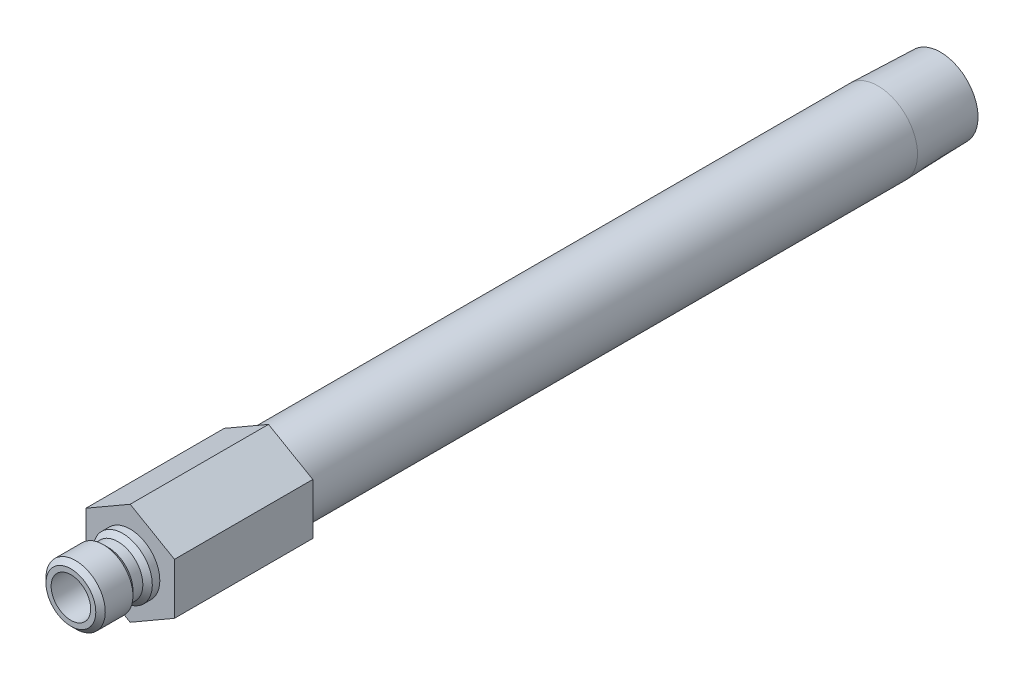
ISO-10303-21;
HEADER;
FILE_DESCRIPTION(('STEP AP214'),'2;1');
FILE_NAME('part.step','',(''),(''),'','','');
FILE_SCHEMA(('AUTOMOTIVE_DESIGN { 1 0 10303 214 1 1 1 1 }'));
ENDSEC;
DATA;
#1=APPLICATION_CONTEXT('core data for automotive mechanical design processes');
#2=APPLICATION_PROTOCOL_DEFINITION('international standard','automotive_design',2000,#1);
#3=PRODUCT_CONTEXT('',#1,'mechanical');
#4=PRODUCT('Part','Part','',(#3));
#5=PRODUCT_RELATED_PRODUCT_CATEGORY('part','',(#4));
#6=PRODUCT_DEFINITION_FORMATION('','',#4);
#7=PRODUCT_DEFINITION_CONTEXT('part definition',#1,'design');
#8=PRODUCT_DEFINITION('design','',#6,#7);
#9=PRODUCT_DEFINITION_SHAPE('','',#8);
#10=(LENGTH_UNIT() NAMED_UNIT(*) SI_UNIT(.MILLI.,.METRE.));
#11=(NAMED_UNIT(*) PLANE_ANGLE_UNIT() SI_UNIT($,.RADIAN.));
#12=(NAMED_UNIT(*) SI_UNIT($,.STERADIAN.) SOLID_ANGLE_UNIT());
#13=UNCERTAINTY_MEASURE_WITH_UNIT(LENGTH_MEASURE(1.E-05),#10,'distance_accuracy_value','');
#14=(GEOMETRIC_REPRESENTATION_CONTEXT(3) GLOBAL_UNCERTAINTY_ASSIGNED_CONTEXT((#13)) GLOBAL_UNIT_ASSIGNED_CONTEXT((#10,
#11,#12)) REPRESENTATION_CONTEXT('',''));
#15=CARTESIAN_POINT('',(0.,0.,0.));
#16=DIRECTION('',(0.,0.,1.));
#17=DIRECTION('',(1.,0.,0.));
#18=AXIS2_PLACEMENT_3D('',#15,#16,#17);
#19=CARTESIAN_POINT('',(0.,0.,0.));
#20=DIRECTION('',(0.,0.,-1.));
#21=DIRECTION('',(0.,1.,0.));
#22=AXIS2_PLACEMENT_3D('',#19,#20,#21);
#23=CYLINDRICAL_SURFACE('',#22,6.34999999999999);
#24=CARTESIAN_POINT('',(0.,0.,-120.142));
#25=DIRECTION('',(0.,0.,-1.));
#26=DIRECTION('',(0.,1.,0.));
#27=AXIS2_PLACEMENT_3D('',#24,#25,#26);
#28=CIRCLE('',#27,6.34999999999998);
#29=CARTESIAN_POINT('',(0.,6.35,-120.142));
#30=VERTEX_POINT('',#29);
#31=EDGE_CURVE('E41',#30,#30,#28,.T.);
#32=ORIENTED_EDGE('',*,*,#31,.F.);
#33=EDGE_LOOP('',(#32));
#34=FACE_BOUND('',#33,.T.);
#35=CARTESIAN_POINT('',(0.,0.,-22.225));
#36=DIRECTION('',(0.,0.,1.));
#37=DIRECTION('',(1.,0.,0.));
#38=AXIS2_PLACEMENT_3D('',#35,#36,#37);
#39=CIRCLE('',#38,6.34999999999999);
#40=CARTESIAN_POINT('',(6.34999999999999,0.,-22.225));
#41=VERTEX_POINT('',#40);
#42=EDGE_CURVE('E137',#41,#41,#39,.F.);
#43=ORIENTED_EDGE('',*,*,#42,.T.);
#44=EDGE_LOOP('',(#43));
#45=FACE_BOUND('',#44,.T.);
#46=ADVANCED_FACE('F32',(#34,#45),#23,.T.);
#47=CARTESIAN_POINT('',(0.,6.03647060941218,-130.175));
#48=DIRECTION('',(0.,0.,-1.));
#49=DIRECTION('',(0.,1.,0.));
#50=AXIS2_PLACEMENT_3D('',#47,#48,#49);
#51=PLANE('',#50);
#52=CARTESIAN_POINT('',(0.,0.,-130.175));
#53=DIRECTION('',(0.,0.,-1.));
#54=DIRECTION('',(0.,1.,0.));
#55=AXIS2_PLACEMENT_3D('',#52,#53,#54);
#56=CIRCLE('',#55,6.03647060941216);
#57=CARTESIAN_POINT('',(0.,6.03647060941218,-130.175));
#58=VERTEX_POINT('',#57);
#59=EDGE_CURVE('E11',#58,#58,#56,.T.);
#60=ORIENTED_EDGE('',*,*,#59,.T.);
#61=EDGE_LOOP('',(#60));
#62=FACE_BOUND('',#61,.T.);
#63=CARTESIAN_POINT('',(0.,0.,-130.175));
#64=DIRECTION('',(0.,0.,-1.));
#65=DIRECTION('',(0.,1.,0.));
#66=AXIS2_PLACEMENT_3D('',#63,#64,#65);
#67=CIRCLE('',#66,4.62279999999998);
#68=CARTESIAN_POINT('',(0.,4.6228,-130.175));
#69=VERTEX_POINT('',#68);
#70=EDGE_CURVE('E145',#69,#69,#67,.T.);
#71=ORIENTED_EDGE('',*,*,#70,.F.);
#72=EDGE_LOOP('',(#71));
#73=FACE_BOUND('',#72,.T.);
#74=ADVANCED_FACE('F34',(#62,#73),#51,.T.);
#75=CARTESIAN_POINT('',(0.,0.,-130.175));
#76=DIRECTION('',(0.,0.,1.));
#77=DIRECTION('',(0.,-1.,0.));
#78=AXIS2_PLACEMENT_3D('',#75,#76,#77);
#79=CONICAL_SURFACE('',#78,6.03647060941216,0.0312396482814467);
#80=ORIENTED_EDGE('',*,*,#31,.T.);
#81=EDGE_LOOP('',(#80));
#82=FACE_BOUND('',#81,.T.);
#83=ORIENTED_EDGE('',*,*,#59,.F.);
#84=EDGE_LOOP('',(#83));
#85=FACE_BOUND('',#84,.T.);
#86=ADVANCED_FACE('F180',(#82,#85),#79,.T.);
#87=CARTESIAN_POINT('',(0.,4.7625,0.));
#88=DIRECTION('',(0.,0.,1.));
#89=DIRECTION('',(0.,-1.,0.));
#90=AXIS2_PLACEMENT_3D('',#87,#88,#89);
#91=PLANE('',#90);
#92=CARTESIAN_POINT('',(0.,0.,0.));
#93=DIRECTION('',(0.,0.,-1.));
#94=DIRECTION('',(0.,1.,0.));
#95=AXIS2_PLACEMENT_3D('',#92,#93,#94);
#96=CIRCLE('',#95,4.7625);
#97=CARTESIAN_POINT('',(0.,4.7625,0.));
#98=VERTEX_POINT('',#97);
#99=EDGE_CURVE('E175',#98,#98,#96,.T.);
#100=ORIENTED_EDGE('',*,*,#99,.T.);
#101=EDGE_LOOP('',(#100));
#102=FACE_BOUND('',#101,.T.);
#103=DIRECTION('',(-0.866025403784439,-0.5,0.));
#104=VECTOR('',#103,1.);
#105=CARTESIAN_POINT('',(0.,8.21223022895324,0.));
#106=LINE('',#105,#104);
#107=CARTESIAN_POINT('',(0.,8.21223022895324,0.));
#108=VERTEX_POINT('',#107);
#109=CARTESIAN_POINT('',(-7.112,4.10611511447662,0.));
#110=VERTEX_POINT('',#109);
#111=EDGE_CURVE('E120',#108,#110,#106,.T.);
#112=ORIENTED_EDGE('',*,*,#111,.T.);
#113=DIRECTION('',(0.,-1.,0.));
#114=VECTOR('',#113,1.);
#115=CARTESIAN_POINT('',(-7.112,4.10611511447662,0.));
#116=LINE('',#115,#114);
#117=CARTESIAN_POINT('',(-7.112,-4.10611511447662,0.));
#118=VERTEX_POINT('',#117);
#119=EDGE_CURVE('E123',#110,#118,#116,.T.);
#120=ORIENTED_EDGE('',*,*,#119,.T.);
#121=DIRECTION('',(0.866025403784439,-0.5,0.));
#122=VECTOR('',#121,1.);
#123=CARTESIAN_POINT('',(-7.112,-4.10611511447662,0.));
#124=LINE('',#123,#122);
#125=CARTESIAN_POINT('',(0.,-8.21223022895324,0.));
#126=VERTEX_POINT('',#125);
#127=EDGE_CURVE('E126',#118,#126,#124,.T.);
#128=ORIENTED_EDGE('',*,*,#127,.T.);
#129=DIRECTION('',(0.866025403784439,0.5,0.));
#130=VECTOR('',#129,1.);
#131=CARTESIAN_POINT('',(0.,-8.21223022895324,0.));
#132=LINE('',#131,#130);
#133=CARTESIAN_POINT('',(7.112,-4.10611511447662,0.));
#134=VERTEX_POINT('',#133);
#135=EDGE_CURVE('E129',#126,#134,#132,.T.);
#136=ORIENTED_EDGE('',*,*,#135,.T.);
#137=DIRECTION('',(0.,1.,0.));
#138=VECTOR('',#137,1.);
#139=CARTESIAN_POINT('',(7.112,-4.10611511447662,0.));
#140=LINE('',#139,#138);
#141=CARTESIAN_POINT('',(7.112,4.10611511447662,0.));
#142=VERTEX_POINT('',#141);
#143=EDGE_CURVE('E97',#134,#142,#140,.T.);
#144=ORIENTED_EDGE('',*,*,#143,.T.);
#145=DIRECTION('',(-0.866025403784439,0.5,0.));
#146=VECTOR('',#145,1.);
#147=CARTESIAN_POINT('',(7.112,4.10611511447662,0.));
#148=LINE('',#147,#146);
#149=EDGE_CURVE('E132',#142,#108,#148,.T.);
#150=ORIENTED_EDGE('',*,*,#149,.T.);
#151=EDGE_LOOP('',(#112,#120,#128,#136,#144,#150));
#152=FACE_BOUND('',#151,.T.);
#153=ADVANCED_FACE('F249',(#102,#152),#91,.T.);
#154=CARTESIAN_POINT('',(0.,0.,0.));
#155=DIRECTION('',(0.,0.,-1.));
#156=DIRECTION('',(0.,1.,0.));
#157=AXIS2_PLACEMENT_3D('',#154,#155,#156);
#158=CYLINDRICAL_SURFACE('',#157,4.7625);
#159=CARTESIAN_POINT('',(0.,0.,1.2065));
#160=DIRECTION('',(0.,0.,-1.));
#161=DIRECTION('',(0.,1.,0.));
#162=AXIS2_PLACEMENT_3D('',#159,#160,#161);
#163=CIRCLE('',#162,4.7625);
#164=CARTESIAN_POINT('',(0.,4.7625,1.2065));
#165=VERTEX_POINT('',#164);
#166=EDGE_CURVE('E172',#165,#165,#163,.T.);
#167=ORIENTED_EDGE('',*,*,#166,.T.);
#168=EDGE_LOOP('',(#167));
#169=FACE_BOUND('',#168,.T.);
#170=ORIENTED_EDGE('',*,*,#99,.F.);
#171=EDGE_LOOP('',(#170));
#172=FACE_BOUND('',#171,.T.);
#173=ADVANCED_FACE('F245',(#169,#172),#158,.T.);
#174=CARTESIAN_POINT('',(0.,0.,1.2065));
#175=DIRECTION('',(0.,0.,-1.));
#176=DIRECTION('',(0.,1.,0.));
#177=AXIS2_PLACEMENT_3D('',#174,#175,#176);
#178=CONICAL_SURFACE('',#177,4.7625,0.785398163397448);
#179=CARTESIAN_POINT('',(0.,0.,1.9685));
#180=DIRECTION('',(0.,0.,-1.));
#181=DIRECTION('',(0.,1.,0.));
#182=AXIS2_PLACEMENT_3D('',#179,#180,#181);
#183=CIRCLE('',#182,4.0005);
#184=CARTESIAN_POINT('',(0.,4.0005,1.9685));
#185=VERTEX_POINT('',#184);
#186=EDGE_CURVE('E169',#185,#185,#183,.T.);
#187=ORIENTED_EDGE('',*,*,#186,.T.);
#188=EDGE_LOOP('',(#187));
#189=FACE_BOUND('',#188,.T.);
#190=ORIENTED_EDGE('',*,*,#166,.F.);
#191=EDGE_LOOP('',(#190));
#192=FACE_BOUND('',#191,.T.);
#193=ADVANCED_FACE('F241',(#189,#192),#178,.T.);
#194=CARTESIAN_POINT('',(0.,0.,0.));
#195=DIRECTION('',(0.,0.,-1.));
#196=DIRECTION('',(0.,1.,0.));
#197=AXIS2_PLACEMENT_3D('',#194,#195,#196);
#198=CYLINDRICAL_SURFACE('',#197,4.0005);
#199=CARTESIAN_POINT('',(0.,0.,3.556));
#200=DIRECTION('',(0.,0.,-1.));
#201=DIRECTION('',(0.,1.,0.));
#202=AXIS2_PLACEMENT_3D('',#199,#200,#201);
#203=CIRCLE('',#202,4.0005);
#204=CARTESIAN_POINT('',(0.,4.0005,3.556));
#205=VERTEX_POINT('',#204);
#206=EDGE_CURVE('E166',#205,#205,#203,.T.);
#207=ORIENTED_EDGE('',*,*,#206,.T.);
#208=EDGE_LOOP('',(#207));
#209=FACE_BOUND('',#208,.T.);
#210=ORIENTED_EDGE('',*,*,#186,.F.);
#211=EDGE_LOOP('',(#210));
#212=FACE_BOUND('',#211,.T.);
#213=ADVANCED_FACE('F237',(#209,#212),#198,.T.);
#214=CARTESIAN_POINT('',(0.,0.,3.556));
#215=DIRECTION('',(0.,0.,1.));
#216=DIRECTION('',(0.,-1.,0.));
#217=AXIS2_PLACEMENT_3D('',#214,#215,#216);
#218=CONICAL_SURFACE('',#217,4.0005,0.785398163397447);
#219=CARTESIAN_POINT('',(0.,0.,4.318));
#220=DIRECTION('',(0.,0.,-1.));
#221=DIRECTION('',(0.,1.,0.));
#222=AXIS2_PLACEMENT_3D('',#219,#220,#221);
#223=CIRCLE('',#222,4.7625);
#224=CARTESIAN_POINT('',(0.,4.7625,4.318));
#225=VERTEX_POINT('',#224);
#226=EDGE_CURVE('E163',#225,#225,#223,.T.);
#227=ORIENTED_EDGE('',*,*,#226,.T.);
#228=EDGE_LOOP('',(#227));
#229=FACE_BOUND('',#228,.T.);
#230=ORIENTED_EDGE('',*,*,#206,.F.);
#231=EDGE_LOOP('',(#230));
#232=FACE_BOUND('',#231,.T.);
#233=ADVANCED_FACE('F233',(#229,#232),#218,.T.);
#234=CARTESIAN_POINT('',(0.,0.,0.));
#235=DIRECTION('',(0.,0.,-1.));
#236=DIRECTION('',(0.,1.,0.));
#237=AXIS2_PLACEMENT_3D('',#234,#235,#236);
#238=CYLINDRICAL_SURFACE('',#237,4.7625);
#239=CARTESIAN_POINT('',(0.,0.,8.763));
#240=DIRECTION('',(0.,0.,-1.));
#241=DIRECTION('',(0.,1.,0.));
#242=AXIS2_PLACEMENT_3D('',#239,#240,#241);
#243=CIRCLE('',#242,4.7625);
#244=CARTESIAN_POINT('',(0.,4.7625,8.763));
#245=VERTEX_POINT('',#244);
#246=EDGE_CURVE('E160',#245,#245,#243,.T.);
#247=ORIENTED_EDGE('',*,*,#246,.T.);
#248=EDGE_LOOP('',(#247));
#249=FACE_BOUND('',#248,.T.);
#250=ORIENTED_EDGE('',*,*,#226,.F.);
#251=EDGE_LOOP('',(#250));
#252=FACE_BOUND('',#251,.T.);
#253=ADVANCED_FACE('F229',(#249,#252),#238,.T.);
#254=CARTESIAN_POINT('',(0.,0.,8.763));
#255=DIRECTION('',(0.,0.,-1.));
#256=DIRECTION('',(0.,1.,0.));
#257=AXIS2_PLACEMENT_3D('',#254,#255,#256);
#258=CONICAL_SURFACE('',#257,4.7625,0.785398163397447);
#259=CARTESIAN_POINT('',(0.,0.,9.525));
#260=DIRECTION('',(0.,0.,-1.));
#261=DIRECTION('',(0.,1.,0.));
#262=AXIS2_PLACEMENT_3D('',#259,#260,#261);
#263=CIRCLE('',#262,4.0005);
#264=CARTESIAN_POINT('',(0.,4.0005,9.525));
#265=VERTEX_POINT('',#264);
#266=EDGE_CURVE('E157',#265,#265,#263,.T.);
#267=ORIENTED_EDGE('',*,*,#266,.T.);
#268=EDGE_LOOP('',(#267));
#269=FACE_BOUND('',#268,.T.);
#270=ORIENTED_EDGE('',*,*,#246,.F.);
#271=EDGE_LOOP('',(#270));
#272=FACE_BOUND('',#271,.T.);
#273=ADVANCED_FACE('F225',(#269,#272),#258,.T.);
#274=CARTESIAN_POINT('',(0.,3.175,9.525));
#275=DIRECTION('',(0.,0.,1.));
#276=DIRECTION('',(0.,-1.,0.));
#277=AXIS2_PLACEMENT_3D('',#274,#275,#276);
#278=PLANE('',#277);
#279=CARTESIAN_POINT('',(0.,0.,9.525));
#280=DIRECTION('',(0.,0.,-1.));
#281=DIRECTION('',(0.,1.,0.));
#282=AXIS2_PLACEMENT_3D('',#279,#280,#281);
#283=CIRCLE('',#282,3.175);
#284=CARTESIAN_POINT('',(0.,3.175,9.525));
#285=VERTEX_POINT('',#284);
#286=EDGE_CURVE('E154',#285,#285,#283,.T.);
#287=ORIENTED_EDGE('',*,*,#286,.T.);
#288=EDGE_LOOP('',(#287));
#289=FACE_BOUND('',#288,.T.);
#290=ORIENTED_EDGE('',*,*,#266,.F.);
#291=EDGE_LOOP('',(#290));
#292=FACE_BOUND('',#291,.T.);
#293=ADVANCED_FACE('F221',(#289,#292),#278,.T.);
#294=CARTESIAN_POINT('',(0.,0.,0.));
#295=DIRECTION('',(0.,0.,-1.));
#296=DIRECTION('',(0.,1.,0.));
#297=AXIS2_PLACEMENT_3D('',#294,#295,#296);
#298=CYLINDRICAL_SURFACE('',#297,3.175);
#299=ORIENTED_EDGE('',*,*,#286,.F.);
#300=EDGE_LOOP('',(#299));
#301=FACE_BOUND('',#300,.T.);
#302=CARTESIAN_POINT('',(0.,0.,-22.225));
#303=DIRECTION('',(0.,0.,-1.));
#304=DIRECTION('',(0.,1.,0.));
#305=AXIS2_PLACEMENT_3D('',#302,#303,#304);
#306=CIRCLE('',#305,3.175);
#307=CARTESIAN_POINT('',(0.,3.175,-22.225));
#308=VERTEX_POINT('',#307);
#309=EDGE_CURVE('E151',#308,#308,#306,.T.);
#310=ORIENTED_EDGE('',*,*,#309,.T.);
#311=EDGE_LOOP('',(#310));
#312=FACE_BOUND('',#311,.T.);
#313=ADVANCED_FACE('F217',(#301,#312),#298,.F.);
#314=CARTESIAN_POINT('',(0.,4.6228,-22.225));
#315=DIRECTION('',(0.,0.,-1.));
#316=DIRECTION('',(0.,1.,0.));
#317=AXIS2_PLACEMENT_3D('',#314,#315,#316);
#318=PLANE('',#317);
#319=CARTESIAN_POINT('',(0.,0.,-22.225));
#320=DIRECTION('',(0.,0.,-1.));
#321=DIRECTION('',(0.,1.,0.));
#322=AXIS2_PLACEMENT_3D('',#319,#320,#321);
#323=CIRCLE('',#322,4.6228);
#324=CARTESIAN_POINT('',(0.,4.6228,-22.225));
#325=VERTEX_POINT('',#324);
#326=EDGE_CURVE('E148',#325,#325,#323,.T.);
#327=ORIENTED_EDGE('',*,*,#326,.T.);
#328=EDGE_LOOP('',(#327));
#329=FACE_BOUND('',#328,.T.);
#330=ORIENTED_EDGE('',*,*,#309,.F.);
#331=EDGE_LOOP('',(#330));
#332=FACE_BOUND('',#331,.T.);
#333=ADVANCED_FACE('F198',(#329,#332),#318,.T.);
#334=CARTESIAN_POINT('',(0.,0.,0.));
#335=DIRECTION('',(0.,0.,-1.));
#336=DIRECTION('',(0.,1.,0.));
#337=AXIS2_PLACEMENT_3D('',#334,#335,#336);
#338=CYLINDRICAL_SURFACE('',#337,4.62279999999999);
#339=ORIENTED_EDGE('',*,*,#70,.T.);
#340=EDGE_LOOP('',(#339));
#341=FACE_BOUND('',#340,.T.);
#342=ORIENTED_EDGE('',*,*,#326,.F.);
#343=EDGE_LOOP('',(#342));
#344=FACE_BOUND('',#343,.T.);
#345=ADVANCED_FACE('F190',(#341,#344),#338,.F.);
#346=CARTESIAN_POINT('',(-7.112,4.10611511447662,-22.225));
#347=DIRECTION('',(0.,0.,1.));
#348=DIRECTION('',(1.,0.,0.));
#349=AXIS2_PLACEMENT_3D('',#346,#347,#348);
#350=PLANE('',#349);
#351=ORIENTED_EDGE('',*,*,#42,.F.);
#352=EDGE_LOOP('',(#351));
#353=FACE_BOUND('',#352,.T.);
#354=DIRECTION('',(-0.866025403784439,-0.5,0.));
#355=VECTOR('',#354,1.);
#356=CARTESIAN_POINT('',(0.,8.21223022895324,-22.225));
#357=LINE('',#356,#355);
#358=CARTESIAN_POINT('',(0.,8.21223022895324,-22.225));
#359=VERTEX_POINT('',#358);
#360=CARTESIAN_POINT('',(-7.112,4.10611511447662,-22.225));
#361=VERTEX_POINT('',#360);
#362=EDGE_CURVE('E135',#359,#361,#357,.T.);
#363=ORIENTED_EDGE('',*,*,#362,.F.);
#364=DIRECTION('',(-0.866025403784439,0.5,0.));
#365=VECTOR('',#364,1.);
#366=CARTESIAN_POINT('',(7.112,4.10611511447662,-22.225));
#367=LINE('',#366,#365);
#368=CARTESIAN_POINT('',(7.112,4.10611511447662,-22.225));
#369=VERTEX_POINT('',#368);
#370=EDGE_CURVE('E110',#369,#359,#367,.T.);
#371=ORIENTED_EDGE('',*,*,#370,.F.);
#372=DIRECTION('',(0.,1.,0.));
#373=VECTOR('',#372,1.);
#374=CARTESIAN_POINT('',(7.112,-4.10611511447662,-22.225));
#375=LINE('',#374,#373);
#376=CARTESIAN_POINT('',(7.112,-4.10611511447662,-22.225));
#377=VERTEX_POINT('',#376);
#378=EDGE_CURVE('E95',#377,#369,#375,.T.);
#379=ORIENTED_EDGE('',*,*,#378,.F.);
#380=DIRECTION('',(0.866025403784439,0.5,0.));
#381=VECTOR('',#380,1.);
#382=CARTESIAN_POINT('',(0.,-8.21223022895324,-22.225));
#383=LINE('',#382,#381);
#384=CARTESIAN_POINT('',(0.,-8.21223022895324,-22.225));
#385=VERTEX_POINT('',#384);
#386=EDGE_CURVE('E108',#385,#377,#383,.T.);
#387=ORIENTED_EDGE('',*,*,#386,.F.);
#388=DIRECTION('',(0.866025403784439,-0.5,0.));
#389=VECTOR('',#388,1.);
#390=CARTESIAN_POINT('',(-7.112,-4.10611511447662,-22.225));
#391=LINE('',#390,#389);
#392=CARTESIAN_POINT('',(-7.112,-4.10611511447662,-22.225));
#393=VERTEX_POINT('',#392);
#394=EDGE_CURVE('E113',#393,#385,#391,.T.);
#395=ORIENTED_EDGE('',*,*,#394,.F.);
#396=DIRECTION('',(0.,-1.,0.));
#397=VECTOR('',#396,1.);
#398=CARTESIAN_POINT('',(-7.112,4.10611511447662,-22.225));
#399=LINE('',#398,#397);
#400=EDGE_CURVE('E115',#361,#393,#399,.T.);
#401=ORIENTED_EDGE('',*,*,#400,.F.);
#402=EDGE_LOOP('',(#363,#371,#379,#387,#395,#401));
#403=FACE_BOUND('',#402,.T.);
#404=ADVANCED_FACE('F106',(#353,#403),#350,.F.);
#405=CARTESIAN_POINT('',(0.,8.21223022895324,-22.225));
#406=DIRECTION('',(-0.5,0.866025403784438,0.));
#407=DIRECTION('',(-0.866025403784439,-0.5,0.));
#408=AXIS2_PLACEMENT_3D('',#405,#406,#407);
#409=PLANE('',#408);
#410=ORIENTED_EDGE('',*,*,#111,.F.);
#411=DIRECTION('',(0.,0.,1.));
#412=VECTOR('',#411,1.);
#413=CARTESIAN_POINT('',(0.,8.21223022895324,-22.225));
#414=LINE('',#413,#412);
#415=EDGE_CURVE('E49',#359,#108,#414,.T.);
#416=ORIENTED_EDGE('',*,*,#415,.F.);
#417=ORIENTED_EDGE('',*,*,#362,.T.);
#418=DIRECTION('',(0.,0.,1.));
#419=VECTOR('',#418,1.);
#420=CARTESIAN_POINT('',(-7.112,4.10611511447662,-22.225));
#421=LINE('',#420,#419);
#422=EDGE_CURVE('E84',#361,#110,#421,.T.);
#423=ORIENTED_EDGE('',*,*,#422,.T.);
#424=EDGE_LOOP('',(#410,#416,#417,#423));
#425=FACE_BOUND('',#424,.T.);
#426=ADVANCED_FACE('F189',(#425),#409,.T.);
#427=CARTESIAN_POINT('',(7.112,4.10611511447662,-22.225));
#428=DIRECTION('',(0.5,0.866025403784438,0.));
#429=DIRECTION('',(-0.866025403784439,0.5,0.));
#430=AXIS2_PLACEMENT_3D('',#427,#428,#429);
#431=PLANE('',#430);
#432=ORIENTED_EDGE('',*,*,#149,.F.);
#433=DIRECTION('',(0.,0.,1.));
#434=VECTOR('',#433,1.);
#435=CARTESIAN_POINT('',(7.112,4.10611511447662,-22.225));
#436=LINE('',#435,#434);
#437=EDGE_CURVE('E72',#369,#142,#436,.T.);
#438=ORIENTED_EDGE('',*,*,#437,.F.);
#439=ORIENTED_EDGE('',*,*,#370,.T.);
#440=ORIENTED_EDGE('',*,*,#415,.T.);
#441=EDGE_LOOP('',(#432,#438,#439,#440));
#442=FACE_BOUND('',#441,.T.);
#443=ADVANCED_FACE('F196',(#442),#431,.T.);
#444=CARTESIAN_POINT('',(7.112,-4.10611511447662,-22.225));
#445=DIRECTION('',(1.,0.,0.));
#446=DIRECTION('',(0.,1.,0.));
#447=AXIS2_PLACEMENT_3D('',#444,#445,#446);
#448=PLANE('',#447);
#449=ORIENTED_EDGE('',*,*,#143,.F.);
#450=DIRECTION('',(0.,0.,1.));
#451=VECTOR('',#450,1.);
#452=CARTESIAN_POINT('',(7.112,-4.10611511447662,-22.225));
#453=LINE('',#452,#451);
#454=EDGE_CURVE('E92',#377,#134,#453,.T.);
#455=ORIENTED_EDGE('',*,*,#454,.F.);
#456=ORIENTED_EDGE('',*,*,#378,.T.);
#457=ORIENTED_EDGE('',*,*,#437,.T.);
#458=EDGE_LOOP('',(#449,#455,#456,#457));
#459=FACE_BOUND('',#458,.T.);
#460=ADVANCED_FACE('F94',(#459),#448,.T.);
#461=CARTESIAN_POINT('',(0.,-8.21223022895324,-22.225));
#462=DIRECTION('',(0.5,-0.866025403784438,0.));
#463=DIRECTION('',(0.866025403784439,0.5,0.));
#464=AXIS2_PLACEMENT_3D('',#461,#462,#463);
#465=PLANE('',#464);
#466=ORIENTED_EDGE('',*,*,#135,.F.);
#467=DIRECTION('',(0.,0.,1.));
#468=VECTOR('',#467,1.);
#469=CARTESIAN_POINT('',(0.,-8.21223022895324,-22.225));
#470=LINE('',#469,#468);
#471=EDGE_CURVE('E102',#385,#126,#470,.T.);
#472=ORIENTED_EDGE('',*,*,#471,.F.);
#473=ORIENTED_EDGE('',*,*,#386,.T.);
#474=ORIENTED_EDGE('',*,*,#454,.T.);
#475=EDGE_LOOP('',(#466,#472,#473,#474));
#476=FACE_BOUND('',#475,.T.);
#477=ADVANCED_FACE('F112',(#476),#465,.T.);
#478=CARTESIAN_POINT('',(-7.112,-4.10611511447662,-22.225));
#479=DIRECTION('',(-0.5,-0.866025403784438,0.));
#480=DIRECTION('',(0.866025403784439,-0.5,0.));
#481=AXIS2_PLACEMENT_3D('',#478,#479,#480);
#482=PLANE('',#481);
#483=ORIENTED_EDGE('',*,*,#127,.F.);
#484=DIRECTION('',(0.,0.,1.));
#485=VECTOR('',#484,1.);
#486=CARTESIAN_POINT('',(-7.112,-4.10611511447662,-22.225));
#487=LINE('',#486,#485);
#488=EDGE_CURVE('E140',#393,#118,#487,.T.);
#489=ORIENTED_EDGE('',*,*,#488,.F.);
#490=ORIENTED_EDGE('',*,*,#394,.T.);
#491=ORIENTED_EDGE('',*,*,#471,.T.);
#492=EDGE_LOOP('',(#483,#489,#490,#491));
#493=FACE_BOUND('',#492,.T.);
#494=ADVANCED_FACE('F208',(#493),#482,.T.);
#495=CARTESIAN_POINT('',(-7.112,4.10611511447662,-22.225));
#496=DIRECTION('',(-1.,0.,0.));
#497=DIRECTION('',(0.,0.,1.));
#498=AXIS2_PLACEMENT_3D('',#495,#496,#497);
#499=PLANE('',#498);
#500=ORIENTED_EDGE('',*,*,#119,.F.);
#501=ORIENTED_EDGE('',*,*,#422,.F.);
#502=ORIENTED_EDGE('',*,*,#400,.T.);
#503=ORIENTED_EDGE('',*,*,#488,.T.);
#504=EDGE_LOOP('',(#500,#501,#502,#503));
#505=FACE_BOUND('',#504,.T.);
#506=ADVANCED_FACE('F211',(#505),#499,.T.);
#507=CLOSED_SHELL('',(#46,#74,#86,#153,#173,#193,#213,#233,#253,#273,#293,#313,#333,#345,#404,
#426,#443,#460,#477,#494,#506));
#508=MANIFOLD_SOLID_BREP('B2',#507);
#509=ADVANCED_BREP_SHAPE_REPRESENTATION('',(#18,#508),#14);
#510=SHAPE_DEFINITION_REPRESENTATION(#9,#509);
ENDSEC;
END-ISO-10303-21;
